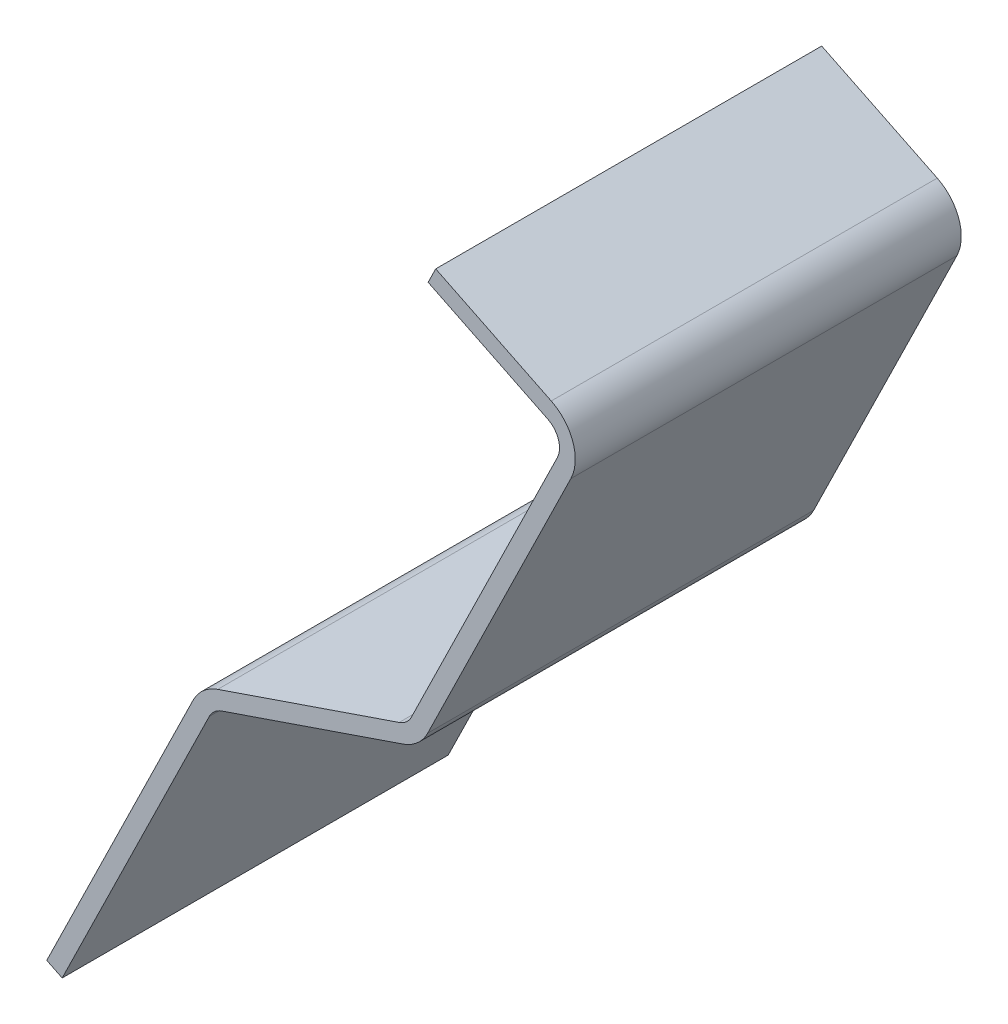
ISO-10303-21;
HEADER;
FILE_DESCRIPTION(('STEP AP214'),'2;1');
FILE_NAME('part.step','',(''),(''),'','','');
FILE_SCHEMA(('AUTOMOTIVE_DESIGN { 1 0 10303 214 1 1 1 1 }'));
ENDSEC;
DATA;
#1=APPLICATION_CONTEXT('core data for automotive mechanical design processes');
#2=APPLICATION_PROTOCOL_DEFINITION('international standard','automotive_design',2000,#1);
#3=PRODUCT_CONTEXT('',#1,'mechanical');
#4=PRODUCT('Part','Part','',(#3));
#5=PRODUCT_RELATED_PRODUCT_CATEGORY('part','',(#4));
#6=PRODUCT_DEFINITION_FORMATION('','',#4);
#7=PRODUCT_DEFINITION_CONTEXT('part definition',#1,'design');
#8=PRODUCT_DEFINITION('design','',#6,#7);
#9=PRODUCT_DEFINITION_SHAPE('','',#8);
#10=(LENGTH_UNIT() NAMED_UNIT(*) SI_UNIT(.MILLI.,.METRE.));
#11=(NAMED_UNIT(*) PLANE_ANGLE_UNIT() SI_UNIT($,.RADIAN.));
#12=(NAMED_UNIT(*) SI_UNIT($,.STERADIAN.) SOLID_ANGLE_UNIT());
#13=UNCERTAINTY_MEASURE_WITH_UNIT(LENGTH_MEASURE(1.E-05),#10,'distance_accuracy_value','');
#14=(GEOMETRIC_REPRESENTATION_CONTEXT(3) GLOBAL_UNCERTAINTY_ASSIGNED_CONTEXT((#13)) GLOBAL_UNIT_ASSIGNED_CONTEXT((#10,
#11,#12)) REPRESENTATION_CONTEXT('',''));
#15=CARTESIAN_POINT('',(0.,0.,0.));
#16=DIRECTION('',(0.,0.,1.));
#17=DIRECTION('',(1.,0.,0.));
#18=AXIS2_PLACEMENT_3D('',#15,#16,#17);
#19=CARTESIAN_POINT('',(88.9357884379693,19.6109610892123,9.));
#20=DIRECTION('',(0.897898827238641,-0.440201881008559,0.));
#21=DIRECTION('',(0.440201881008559,0.897898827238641,0.));
#22=AXIS2_PLACEMENT_3D('',#19,#20,#21);
#23=PLANE('',#22);
#24=DIRECTION('',(-0.440201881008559,-0.897898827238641,0.));
#25=VECTOR('',#24,1.);
#26=CARTESIAN_POINT('',(88.9357884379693,19.6109610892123,9.));
#27=LINE('',#26,#25);
#28=CARTESIAN_POINT('',(88.8263858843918,19.3878079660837,9.));
#29=VERTEX_POINT('',#28);
#30=CARTESIAN_POINT('',(85.4141733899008,12.4277704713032,9.));
#31=VERTEX_POINT('',#30);
#32=EDGE_CURVE('E188',#29,#31,#27,.T.);
#33=ORIENTED_EDGE('',*,*,#32,.F.);
#34=DIRECTION('',(0.,0.,-1.));
#35=VECTOR('',#34,1.);
#36=CARTESIAN_POINT('',(88.8263858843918,19.3878079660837,9.));
#37=LINE('',#36,#35);
#38=CARTESIAN_POINT('',(88.8263858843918,19.3878079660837,0.));
#39=VERTEX_POINT('',#38);
#40=EDGE_CURVE('E36',#29,#39,#37,.T.);
#41=ORIENTED_EDGE('',*,*,#40,.T.);
#42=DIRECTION('',(-0.440201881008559,-0.897898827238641,0.));
#43=VECTOR('',#42,1.);
#44=CARTESIAN_POINT('',(88.9357884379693,19.6109610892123,0.));
#45=LINE('',#44,#43);
#46=CARTESIAN_POINT('',(85.4141733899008,12.4277704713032,0.));
#47=VERTEX_POINT('',#46);
#48=EDGE_CURVE('E143',#39,#47,#45,.T.);
#49=ORIENTED_EDGE('',*,*,#48,.T.);
#50=DIRECTION('',(0.,0.,-1.));
#51=VECTOR('',#50,1.);
#52=CARTESIAN_POINT('',(85.4141733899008,12.4277704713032,9.));
#53=LINE('',#52,#51);
#54=EDGE_CURVE('E146',#31,#47,#53,.T.);
#55=ORIENTED_EDGE('',*,*,#54,.F.);
#56=EDGE_LOOP('',(#33,#41,#49,#55));
#57=FACE_BOUND('',#56,.T.);
#58=ADVANCED_FACE('F29',(#57),#23,.F.);
#59=CARTESIAN_POINT('',(85.7733329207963,12.2516897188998,9.));
#60=DIRECTION('',(-0.440201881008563,-0.897898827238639,0.));
#61=DIRECTION('',(0.897898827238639,-0.440201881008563,0.));
#62=AXIS2_PLACEMENT_3D('',#59,#60,#61);
#63=PLANE('',#62);
#64=DIRECTION('',(-0.897898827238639,0.440201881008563,0.));
#65=VECTOR('',#64,1.);
#66=CARTESIAN_POINT('',(85.7733329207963,12.2516897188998,0.));
#67=LINE('',#66,#65);
#68=CARTESIAN_POINT('',(85.7733329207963,12.2516897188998,0.));
#69=VERTEX_POINT('',#68);
#70=EDGE_CURVE('E151',#69,#47,#67,.T.);
#71=ORIENTED_EDGE('',*,*,#70,.F.);
#72=DIRECTION('',(0.,0.,-1.));
#73=VECTOR('',#72,1.);
#74=CARTESIAN_POINT('',(85.7733329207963,12.2516897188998,9.));
#75=LINE('',#74,#73);
#76=CARTESIAN_POINT('',(85.7733329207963,12.2516897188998,9.));
#77=VERTEX_POINT('',#76);
#78=EDGE_CURVE('E160',#77,#69,#75,.T.);
#79=ORIENTED_EDGE('',*,*,#78,.F.);
#80=DIRECTION('',(-0.897898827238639,0.440201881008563,0.));
#81=VECTOR('',#80,1.);
#82=CARTESIAN_POINT('',(85.7733329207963,12.2516897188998,9.));
#83=LINE('',#82,#81);
#84=EDGE_CURVE('E158',#77,#31,#83,.T.);
#85=ORIENTED_EDGE('',*,*,#84,.T.);
#86=ORIENTED_EDGE('',*,*,#54,.T.);
#87=EDGE_LOOP('',(#71,#79,#85,#86));
#88=FACE_BOUND('',#87,.T.);
#89=ADVANCED_FACE('F155',(#88),#63,.T.);
#90=CARTESIAN_POINT('',(89.2949479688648,19.4348803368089,9.));
#91=DIRECTION('',(0.897898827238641,-0.440201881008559,0.));
#92=DIRECTION('',(0.440201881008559,0.897898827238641,0.));
#93=AXIS2_PLACEMENT_3D('',#90,#91,#92);
#94=PLANE('',#93);
#95=DIRECTION('',(-0.440201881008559,-0.897898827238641,0.));
#96=VECTOR('',#95,1.);
#97=CARTESIAN_POINT('',(89.2949479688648,19.4348803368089,0.));
#98=LINE('',#97,#96);
#99=CARTESIAN_POINT('',(89.2037791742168,19.2489194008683,0.));
#100=VERTEX_POINT('',#99);
#101=EDGE_CURVE('E165',#100,#69,#98,.T.);
#102=ORIENTED_EDGE('',*,*,#101,.F.);
#103=DIRECTION('',(0.,0.,-1.));
#104=VECTOR('',#103,1.);
#105=CARTESIAN_POINT('',(89.2037791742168,19.2489194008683,9.));
#106=LINE('',#105,#104);
#107=CARTESIAN_POINT('',(89.2037791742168,19.2489194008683,9.));
#108=VERTEX_POINT('',#107);
#109=EDGE_CURVE('E230',#100,#108,#106,.F.);
#110=ORIENTED_EDGE('',*,*,#109,.T.);
#111=DIRECTION('',(-0.440201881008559,-0.897898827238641,0.));
#112=VECTOR('',#111,1.);
#113=CARTESIAN_POINT('',(89.2949479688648,19.4348803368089,9.));
#114=LINE('',#113,#112);
#115=EDGE_CURVE('E191',#108,#77,#114,.T.);
#116=ORIENTED_EDGE('',*,*,#115,.T.);
#117=ORIENTED_EDGE('',*,*,#78,.T.);
#118=EDGE_LOOP('',(#102,#110,#116,#117));
#119=FACE_BOUND('',#118,.T.);
#120=ADVANCED_FACE('F293',(#119),#94,.T.);
#121=CARTESIAN_POINT('',(94.1121105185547,21.0825893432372,9.));
#122=DIRECTION('',(0.323640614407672,-0.946180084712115,0.));
#123=DIRECTION('',(0.946180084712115,0.323640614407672,0.));
#124=AXIS2_PLACEMENT_3D('',#121,#122,#123);
#125=PLANE('',#124);
#126=DIRECTION('',(-0.946180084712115,-0.323640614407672,0.));
#127=VECTOR('',#126,1.);
#128=CARTESIAN_POINT('',(94.1121105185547,21.0825893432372,0.));
#129=LINE('',#128,#127);
#130=CARTESIAN_POINT('',(93.7201898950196,20.9485330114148,0.));
#131=VERTEX_POINT('',#130);
#132=CARTESIAN_POINT('',(89.4909082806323,19.5019085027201,0.));
#133=VERTEX_POINT('',#132);
#134=EDGE_CURVE('E168',#131,#133,#129,.T.);
#135=ORIENTED_EDGE('',*,*,#134,.F.);
#136=DIRECTION('',(0.,0.,-1.));
#137=VECTOR('',#136,1.);
#138=CARTESIAN_POINT('',(93.7201898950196,20.9485330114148,9.));
#139=LINE('',#138,#137);
#140=CARTESIAN_POINT('',(93.7201898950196,20.9485330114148,9.));
#141=VERTEX_POINT('',#140);
#142=EDGE_CURVE('E49',#131,#141,#139,.F.);
#143=ORIENTED_EDGE('',*,*,#142,.T.);
#144=DIRECTION('',(-0.946180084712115,-0.323640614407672,0.));
#145=VECTOR('',#144,1.);
#146=CARTESIAN_POINT('',(94.1121105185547,21.0825893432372,9.));
#147=LINE('',#146,#145);
#148=CARTESIAN_POINT('',(89.4909082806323,19.5019085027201,9.));
#149=VERTEX_POINT('',#148);
#150=EDGE_CURVE('E193',#141,#149,#147,.T.);
#151=ORIENTED_EDGE('',*,*,#150,.T.);
#152=DIRECTION('',(0.,0.,-1.));
#153=VECTOR('',#152,1.);
#154=CARTESIAN_POINT('',(89.4909082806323,19.5019085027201,0.));
#155=LINE('',#154,#153);
#156=EDGE_CURVE('E227',#149,#133,#155,.T.);
#157=ORIENTED_EDGE('',*,*,#156,.T.);
#158=EDGE_LOOP('',(#135,#143,#151,#157));
#159=FACE_BOUND('',#158,.T.);
#160=ADVANCED_FACE('F286',(#159),#125,.T.);
#161=CARTESIAN_POINT('',(94.1121105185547,21.0825893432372,9.));
#162=DIRECTION('',(0.89789882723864,-0.44020188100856,0.));
#163=DIRECTION('',(0.440201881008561,0.89789882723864,0.));
#164=AXIS2_PLACEMENT_3D('',#161,#162,#163);
#165=PLANE('',#164);
#166=DIRECTION('',(-0.44020188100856,-0.89789882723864,0.));
#167=VECTOR('',#166,1.);
#168=CARTESIAN_POINT('',(94.1121105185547,21.0825893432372,0.));
#169=LINE('',#168,#167);
#170=CARTESIAN_POINT('',(97.6337255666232,28.2657799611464,0.));
#171=VERTEX_POINT('',#170);
#172=CARTESIAN_POINT('',(94.2944481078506,21.4545112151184,0.));
#173=VERTEX_POINT('',#172);
#174=EDGE_CURVE('E172',#171,#173,#169,.T.);
#175=ORIENTED_EDGE('',*,*,#174,.F.);
#176=DIRECTION('',(0.,0.,-1.));
#177=VECTOR('',#176,1.);
#178=CARTESIAN_POINT('',(97.6337255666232,28.2657799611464,9.));
#179=LINE('',#178,#177);
#180=CARTESIAN_POINT('',(97.6337255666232,28.2657799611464,9.));
#181=VERTEX_POINT('',#180);
#182=EDGE_CURVE('E257',#171,#181,#179,.F.);
#183=ORIENTED_EDGE('',*,*,#182,.T.);
#184=DIRECTION('',(-0.44020188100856,-0.89789882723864,0.));
#185=VECTOR('',#184,1.);
#186=CARTESIAN_POINT('',(94.1121105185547,21.0825893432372,9.));
#187=LINE('',#186,#185);
#188=CARTESIAN_POINT('',(94.2944481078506,21.4545112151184,9.));
#189=VERTEX_POINT('',#188);
#190=EDGE_CURVE('E195',#181,#189,#187,.T.);
#191=ORIENTED_EDGE('',*,*,#190,.T.);
#192=DIRECTION('',(0.,0.,-1.));
#193=VECTOR('',#192,1.);
#194=CARTESIAN_POINT('',(94.2944481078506,21.4545112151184,9.));
#195=LINE('',#194,#193);
#196=EDGE_CURVE('E254',#189,#173,#195,.T.);
#197=ORIENTED_EDGE('',*,*,#196,.T.);
#198=EDGE_LOOP('',(#175,#183,#191,#197));
#199=FACE_BOUND('',#198,.T.);
#200=ADVANCED_FACE('F280',(#199),#165,.T.);
#201=CARTESIAN_POINT('',(95.3802309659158,30.4842844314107,9.));
#202=DIRECTION('',(0.440201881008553,0.897898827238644,0.));
#203=DIRECTION('',(-0.897898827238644,0.440201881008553,0.));
#204=AXIS2_PLACEMENT_3D('',#201,#202,#203);
#205=PLANE('',#204);
#206=DIRECTION('',(0.897898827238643,-0.440201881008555,0.));
#207=VECTOR('',#206,1.);
#208=CARTESIAN_POINT('',(98.0739274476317,29.163678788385,9.));
#209=LINE('',#208,#207);
#210=CARTESIAN_POINT('',(94.4823321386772,30.9244863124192,9.));
#211=VERTEX_POINT('',#210);
#212=CARTESIAN_POINT('',(97.1760286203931,29.6038806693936,9.));
#213=VERTEX_POINT('',#212);
#214=EDGE_CURVE('E198',#211,#213,#209,.T.);
#215=ORIENTED_EDGE('',*,*,#214,.T.);
#216=DIRECTION('',(0.,0.,-1.));
#217=VECTOR('',#216,1.);
#218=CARTESIAN_POINT('',(97.1760286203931,29.6038806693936,9.));
#219=LINE('',#218,#217);
#220=CARTESIAN_POINT('',(97.1760286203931,29.6038806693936,0.));
#221=VERTEX_POINT('',#220);
#222=EDGE_CURVE('E245',#213,#221,#219,.T.);
#223=ORIENTED_EDGE('',*,*,#222,.T.);
#224=DIRECTION('',(0.897898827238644,-0.440201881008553,0.));
#225=VECTOR('',#224,1.);
#226=CARTESIAN_POINT('',(95.3802309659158,30.4842844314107,0.));
#227=LINE('',#226,#225);
#228=CARTESIAN_POINT('',(94.4823321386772,30.9244863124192,0.));
#229=VERTEX_POINT('',#228);
#230=EDGE_CURVE('E175',#229,#221,#227,.T.);
#231=ORIENTED_EDGE('',*,*,#230,.F.);
#232=DIRECTION('',(0.,0.,-1.));
#233=VECTOR('',#232,1.);
#234=CARTESIAN_POINT('',(94.4823321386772,30.9244863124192,9.));
#235=LINE('',#234,#233);
#236=EDGE_CURVE('E215',#211,#229,#235,.T.);
#237=ORIENTED_EDGE('',*,*,#236,.F.);
#238=EDGE_LOOP('',(#215,#223,#231,#237));
#239=FACE_BOUND('',#238,.T.);
#240=ADVANCED_FACE('F275',(#239),#205,.T.);
#241=CARTESIAN_POINT('',(94.3062513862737,30.5653267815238,9.));
#242=DIRECTION('',(-0.897898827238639,0.440201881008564,0.));
#243=DIRECTION('',(-0.440201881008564,-0.897898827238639,0.));
#244=AXIS2_PLACEMENT_3D('',#241,#242,#243);
#245=PLANE('',#244);
#246=DIRECTION('',(0.440201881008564,0.897898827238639,0.));
#247=VECTOR('',#246,1.);
#248=CARTESIAN_POINT('',(94.3062513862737,30.5653267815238,0.));
#249=LINE('',#248,#247);
#250=CARTESIAN_POINT('',(94.3062513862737,30.5653267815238,0.));
#251=VERTEX_POINT('',#250);
#252=EDGE_CURVE('E177',#251,#229,#249,.T.);
#253=ORIENTED_EDGE('',*,*,#252,.F.);
#254=DIRECTION('',(0.,0.,-1.));
#255=VECTOR('',#254,1.);
#256=CARTESIAN_POINT('',(94.3062513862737,30.5653267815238,9.));
#257=LINE('',#256,#255);
#258=CARTESIAN_POINT('',(94.3062513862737,30.5653267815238,9.));
#259=VERTEX_POINT('',#258);
#260=EDGE_CURVE('E212',#259,#251,#257,.T.);
#261=ORIENTED_EDGE('',*,*,#260,.F.);
#262=DIRECTION('',(0.440201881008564,0.897898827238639,0.));
#263=VECTOR('',#262,1.);
#264=CARTESIAN_POINT('',(94.3062513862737,30.5653267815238,9.));
#265=LINE('',#264,#263);
#266=EDGE_CURVE('E201',#259,#211,#265,.T.);
#267=ORIENTED_EDGE('',*,*,#266,.T.);
#268=ORIENTED_EDGE('',*,*,#236,.T.);
#269=EDGE_LOOP('',(#253,#261,#267,#268));
#270=FACE_BOUND('',#269,.T.);
#271=ADVANCED_FACE('F319',(#270),#245,.T.);
#272=CARTESIAN_POINT('',(97.8978466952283,28.8045192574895,9.));
#273=DIRECTION('',(0.440201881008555,0.897898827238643,0.));
#274=DIRECTION('',(-0.897898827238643,0.440201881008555,0.));
#275=AXIS2_PLACEMENT_3D('',#272,#273,#274);
#276=PLANE('',#275);
#277=DIRECTION('',(0.897898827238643,-0.440201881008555,0.));
#278=VECTOR('',#277,1.);
#279=CARTESIAN_POINT('',(97.8978466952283,28.8045192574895,0.));
#280=LINE('',#279,#278);
#281=CARTESIAN_POINT('',(97.0897377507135,29.2007009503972,0.));
#282=VERTEX_POINT('',#281);
#283=EDGE_CURVE('E180',#251,#282,#280,.T.);
#284=ORIENTED_EDGE('',*,*,#283,.T.);
#285=DIRECTION('',(0.,0.,-1.));
#286=VECTOR('',#285,1.);
#287=CARTESIAN_POINT('',(97.0897377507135,29.2007009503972,9.));
#288=LINE('',#287,#286);
#289=CARTESIAN_POINT('',(97.0897377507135,29.2007009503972,9.));
#290=VERTEX_POINT('',#289);
#291=EDGE_CURVE('E225',#282,#290,#288,.F.);
#292=ORIENTED_EDGE('',*,*,#291,.T.);
#293=DIRECTION('',(0.897898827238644,-0.440201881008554,0.));
#294=VECTOR('',#293,1.);
#295=CARTESIAN_POINT('',(95.2041502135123,30.1251249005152,9.));
#296=LINE('',#295,#294);
#297=EDGE_CURVE('E204',#259,#290,#296,.T.);
#298=ORIENTED_EDGE('',*,*,#297,.F.);
#299=ORIENTED_EDGE('',*,*,#260,.T.);
#300=EDGE_LOOP('',(#284,#292,#298,#299));
#301=FACE_BOUND('',#300,.T.);
#302=ADVANCED_FACE('F315',(#301),#276,.F.);
#303=CARTESIAN_POINT('',(93.7529509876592,21.2586700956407,9.));
#304=DIRECTION('',(0.89789882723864,-0.44020188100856,0.));
#305=DIRECTION('',(0.44020188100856,0.89789882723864,0.));
#306=AXIS2_PLACEMENT_3D('',#303,#304,#305);
#307=PLANE('',#306);
#308=DIRECTION('',(-0.440201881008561,-0.89789882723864,0.));
#309=VECTOR('',#308,1.);
#310=CARTESIAN_POINT('',(93.7529509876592,21.2586700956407,0.));
#311=LINE('',#310,#309);
#312=CARTESIAN_POINT('',(97.3185862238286,28.5316505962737,0.));
#313=VERTEX_POINT('',#312);
#314=CARTESIAN_POINT('',(93.9170548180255,21.5933997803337,0.));
#315=VERTEX_POINT('',#314);
#316=EDGE_CURVE('E183',#313,#315,#311,.T.);
#317=ORIENTED_EDGE('',*,*,#316,.T.);
#318=DIRECTION('',(0.,0.,-1.));
#319=VECTOR('',#318,1.);
#320=CARTESIAN_POINT('',(93.9170548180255,21.5933997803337,9.));
#321=LINE('',#320,#319);
#322=CARTESIAN_POINT('',(93.9170548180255,21.5933997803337,9.));
#323=VERTEX_POINT('',#322);
#324=EDGE_CURVE('E223',#315,#323,#321,.F.);
#325=ORIENTED_EDGE('',*,*,#324,.T.);
#326=DIRECTION('',(-0.440201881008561,-0.89789882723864,0.));
#327=VECTOR('',#326,1.);
#328=CARTESIAN_POINT('',(93.7529509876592,21.2586700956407,9.));
#329=LINE('',#328,#327);
#330=CARTESIAN_POINT('',(97.3185862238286,28.5316505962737,9.));
#331=VERTEX_POINT('',#330);
#332=EDGE_CURVE('E207',#331,#323,#329,.T.);
#333=ORIENTED_EDGE('',*,*,#332,.F.);
#334=DIRECTION('',(0.,0.,-1.));
#335=VECTOR('',#334,1.);
#336=CARTESIAN_POINT('',(97.3185862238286,28.5316505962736,0.));
#337=LINE('',#336,#335);
#338=EDGE_CURVE('E220',#331,#313,#337,.T.);
#339=ORIENTED_EDGE('',*,*,#338,.T.);
#340=EDGE_LOOP('',(#317,#325,#333,#339));
#341=FACE_BOUND('',#340,.T.);
#342=ADVANCED_FACE('F307',(#341),#307,.F.);
#343=CARTESIAN_POINT('',(93.9826542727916,21.4610613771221,9.));
#344=DIRECTION('',(0.323640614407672,-0.946180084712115,0.));
#345=DIRECTION('',(0.946180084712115,0.323640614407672,0.));
#346=AXIS2_PLACEMENT_3D('',#343,#344,#345);
#347=PLANE('',#346);
#348=DIRECTION('',(-0.946180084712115,-0.323640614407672,0.));
#349=VECTOR('',#348,1.);
#350=CARTESIAN_POINT('',(93.9826542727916,21.4610613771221,0.));
#351=LINE('',#350,#349);
#352=CARTESIAN_POINT('',(93.6299257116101,21.3404106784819,0.));
#353=VERTEX_POINT('',#352);
#354=CARTESIAN_POINT('',(89.4006440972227,19.8937861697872,0.));
#355=VERTEX_POINT('',#354);
#356=EDGE_CURVE('E186',#353,#355,#351,.T.);
#357=ORIENTED_EDGE('',*,*,#356,.T.);
#358=DIRECTION('',(0.,0.,-1.));
#359=VECTOR('',#358,1.);
#360=CARTESIAN_POINT('',(89.4006440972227,19.8937861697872,9.));
#361=LINE('',#360,#359);
#362=CARTESIAN_POINT('',(89.4006440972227,19.8937861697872,9.));
#363=VERTEX_POINT('',#362);
#364=EDGE_CURVE('E11',#355,#363,#361,.F.);
#365=ORIENTED_EDGE('',*,*,#364,.T.);
#366=DIRECTION('',(-0.946180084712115,-0.323640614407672,0.));
#367=VECTOR('',#366,1.);
#368=CARTESIAN_POINT('',(93.9826542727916,21.4610613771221,9.));
#369=LINE('',#368,#367);
#370=CARTESIAN_POINT('',(93.6299257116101,21.3404106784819,9.));
#371=VERTEX_POINT('',#370);
#372=EDGE_CURVE('E210',#371,#363,#369,.T.);
#373=ORIENTED_EDGE('',*,*,#372,.F.);
#374=DIRECTION('',(0.,0.,-1.));
#375=VECTOR('',#374,1.);
#376=CARTESIAN_POINT('',(93.6299257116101,21.3404106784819,0.));
#377=LINE('',#376,#375);
#378=EDGE_CURVE('E159',#371,#353,#377,.T.);
#379=ORIENTED_EDGE('',*,*,#378,.T.);
#380=EDGE_LOOP('',(#357,#365,#373,#379));
#381=FACE_BOUND('',#380,.T.);
#382=ADVANCED_FACE('F299',(#381),#347,.F.);
#383=CARTESIAN_POINT('',(94.4823321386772,30.9244863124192,9.));
#384=DIRECTION('',(0.,0.,1.));
#385=DIRECTION('',(1.,0.,0.));
#386=AXIS2_PLACEMENT_3D('',#383,#384,#385);
#387=PLANE('',#386);
#388=ORIENTED_EDGE('',*,*,#190,.F.);
#389=CARTESIAN_POINT('',(96.7358267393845,28.7059818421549,9.));
#390=DIRECTION('',(0.,0.,1.));
#391=DIRECTION('',(1.,0.,0.));
#392=AXIS2_PLACEMENT_3D('',#389,#390,#391);
#393=CIRCLE('',#392,1.);
#394=EDGE_CURVE('E263',#181,#213,#393,.T.);
#395=ORIENTED_EDGE('',*,*,#394,.T.);
#396=ORIENTED_EDGE('',*,*,#214,.F.);
#397=ORIENTED_EDGE('',*,*,#266,.F.);
#398=ORIENTED_EDGE('',*,*,#297,.T.);
#399=CARTESIAN_POINT('',(96.8696368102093,28.7517515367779,9.));
#400=DIRECTION('',(0.,0.,1.));
#401=DIRECTION('',(1.,0.,0.));
#402=AXIS2_PLACEMENT_3D('',#399,#400,#401);
#403=CIRCLE('',#402,0.5);
#404=EDGE_CURVE('E238',#290,#331,#403,.F.);
#405=ORIENTED_EDGE('',*,*,#404,.T.);
#406=ORIENTED_EDGE('',*,*,#332,.T.);
#407=CARTESIAN_POINT('',(93.4681054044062,21.813500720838,9.));
#408=DIRECTION('',(0.,0.,1.));
#409=DIRECTION('',(1.,0.,0.));
#410=AXIS2_PLACEMENT_3D('',#407,#408,#409);
#411=CIRCLE('',#410,0.5);
#412=EDGE_CURVE('E234',#323,#371,#411,.F.);
#413=ORIENTED_EDGE('',*,*,#412,.T.);
#414=ORIENTED_EDGE('',*,*,#372,.T.);
#415=CARTESIAN_POINT('',(89.7242847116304,18.9476060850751,9.));
#416=DIRECTION('',(0.,0.,1.));
#417=DIRECTION('',(1.,0.,0.));
#418=AXIS2_PLACEMENT_3D('',#415,#416,#417);
#419=CIRCLE('',#418,1.);
#420=EDGE_CURVE('E259',#363,#29,#419,.T.);
#421=ORIENTED_EDGE('',*,*,#420,.T.);
#422=ORIENTED_EDGE('',*,*,#32,.T.);
#423=ORIENTED_EDGE('',*,*,#84,.F.);
#424=ORIENTED_EDGE('',*,*,#115,.F.);
#425=CARTESIAN_POINT('',(89.6527285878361,19.0288184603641,9.));
#426=DIRECTION('',(0.,0.,1.));
#427=DIRECTION('',(1.,0.,0.));
#428=AXIS2_PLACEMENT_3D('',#425,#426,#427);
#429=CIRCLE('',#428,0.5);
#430=EDGE_CURVE('E242',#108,#149,#429,.F.);
#431=ORIENTED_EDGE('',*,*,#430,.T.);
#432=ORIENTED_EDGE('',*,*,#150,.F.);
#433=CARTESIAN_POINT('',(93.3965492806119,21.8947130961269,9.));
#434=DIRECTION('',(0.,0.,1.));
#435=DIRECTION('',(1.,0.,0.));
#436=AXIS2_PLACEMENT_3D('',#433,#434,#435);
#437=CIRCLE('',#436,1.);
#438=EDGE_CURVE('E261',#141,#189,#437,.T.);
#439=ORIENTED_EDGE('',*,*,#438,.T.);
#440=EDGE_LOOP('',(#388,#395,#396,#397,#398,#405,#406,#413,#414,#421,#422,#423,#424,#431,#432,#439));
#441=FACE_BOUND('',#440,.T.);
#442=ADVANCED_FACE('F268',(#441),#387,.T.);
#443=CARTESIAN_POINT('',(94.4823321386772,30.9244863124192,0.));
#444=DIRECTION('',(0.,0.,1.));
#445=DIRECTION('',(1.,0.,0.));
#446=AXIS2_PLACEMENT_3D('',#443,#444,#445);
#447=PLANE('',#446);
#448=ORIENTED_EDGE('',*,*,#230,.T.);
#449=CARTESIAN_POINT('',(96.7358267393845,28.7059818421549,0.));
#450=DIRECTION('',(0.,0.,1.));
#451=DIRECTION('',(1.,0.,0.));
#452=AXIS2_PLACEMENT_3D('',#449,#450,#451);
#453=CIRCLE('',#452,1.);
#454=EDGE_CURVE('E252',#221,#171,#453,.F.);
#455=ORIENTED_EDGE('',*,*,#454,.T.);
#456=ORIENTED_EDGE('',*,*,#174,.T.);
#457=CARTESIAN_POINT('',(93.3965492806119,21.8947130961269,0.));
#458=DIRECTION('',(0.,0.,1.));
#459=DIRECTION('',(1.,0.,0.));
#460=AXIS2_PLACEMENT_3D('',#457,#458,#459);
#461=CIRCLE('',#460,1.);
#462=EDGE_CURVE('E250',#173,#131,#461,.F.);
#463=ORIENTED_EDGE('',*,*,#462,.T.);
#464=ORIENTED_EDGE('',*,*,#134,.T.);
#465=CARTESIAN_POINT('',(89.6527285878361,19.0288184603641,0.));
#466=DIRECTION('',(0.,0.,1.));
#467=DIRECTION('',(1.,0.,0.));
#468=AXIS2_PLACEMENT_3D('',#465,#466,#467);
#469=CIRCLE('',#468,0.5);
#470=EDGE_CURVE('E240',#133,#100,#469,.T.);
#471=ORIENTED_EDGE('',*,*,#470,.T.);
#472=ORIENTED_EDGE('',*,*,#101,.T.);
#473=ORIENTED_EDGE('',*,*,#70,.T.);
#474=ORIENTED_EDGE('',*,*,#48,.F.);
#475=CARTESIAN_POINT('',(89.7242847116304,18.9476060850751,0.));
#476=DIRECTION('',(0.,0.,1.));
#477=DIRECTION('',(1.,0.,0.));
#478=AXIS2_PLACEMENT_3D('',#475,#476,#477);
#479=CIRCLE('',#478,1.);
#480=EDGE_CURVE('E248',#39,#355,#479,.F.);
#481=ORIENTED_EDGE('',*,*,#480,.T.);
#482=ORIENTED_EDGE('',*,*,#356,.F.);
#483=CARTESIAN_POINT('',(93.4681054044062,21.813500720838,0.));
#484=DIRECTION('',(0.,0.,1.));
#485=DIRECTION('',(1.,0.,0.));
#486=AXIS2_PLACEMENT_3D('',#483,#484,#485);
#487=CIRCLE('',#486,0.5);
#488=EDGE_CURVE('E232',#353,#315,#487,.T.);
#489=ORIENTED_EDGE('',*,*,#488,.T.);
#490=ORIENTED_EDGE('',*,*,#316,.F.);
#491=CARTESIAN_POINT('',(96.8696368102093,28.7517515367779,0.));
#492=DIRECTION('',(0.,0.,1.));
#493=DIRECTION('',(1.,0.,0.));
#494=AXIS2_PLACEMENT_3D('',#491,#492,#493);
#495=CIRCLE('',#494,0.5);
#496=EDGE_CURVE('E236',#313,#282,#495,.T.);
#497=ORIENTED_EDGE('',*,*,#496,.T.);
#498=ORIENTED_EDGE('',*,*,#283,.F.);
#499=ORIENTED_EDGE('',*,*,#252,.T.);
#500=EDGE_LOOP('',(#448,#455,#456,#463,#464,#471,#472,#473,#474,#481,#482,#489,#490,#497,#498,#499));
#501=FACE_BOUND('',#500,.T.);
#502=ADVANCED_FACE('F163',(#501),#447,.F.);
#503=CARTESIAN_POINT('',(93.4681054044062,21.813500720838,9.));
#504=DIRECTION('',(0.,0.,1.));
#505=DIRECTION('',(1.,0.,0.));
#506=AXIS2_PLACEMENT_3D('',#503,#504,#505);
#507=CYLINDRICAL_SURFACE('',#506,0.5);
#508=ORIENTED_EDGE('',*,*,#412,.F.);
#509=ORIENTED_EDGE('',*,*,#324,.F.);
#510=ORIENTED_EDGE('',*,*,#488,.F.);
#511=ORIENTED_EDGE('',*,*,#378,.F.);
#512=EDGE_LOOP('',(#508,#509,#510,#511));
#513=FACE_BOUND('',#512,.T.);
#514=ADVANCED_FACE('F303',(#513),#507,.F.);
#515=CARTESIAN_POINT('',(96.8696368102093,28.7517515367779,9.));
#516=DIRECTION('',(0.,0.,1.));
#517=DIRECTION('',(1.,0.,0.));
#518=AXIS2_PLACEMENT_3D('',#515,#516,#517);
#519=CYLINDRICAL_SURFACE('',#518,0.5);
#520=ORIENTED_EDGE('',*,*,#404,.F.);
#521=ORIENTED_EDGE('',*,*,#291,.F.);
#522=ORIENTED_EDGE('',*,*,#496,.F.);
#523=ORIENTED_EDGE('',*,*,#338,.F.);
#524=EDGE_LOOP('',(#520,#521,#522,#523));
#525=FACE_BOUND('',#524,.T.);
#526=ADVANCED_FACE('F312',(#525),#519,.F.);
#527=CARTESIAN_POINT('',(89.6527285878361,19.0288184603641,9.));
#528=DIRECTION('',(0.,0.,1.));
#529=DIRECTION('',(1.,0.,0.));
#530=AXIS2_PLACEMENT_3D('',#527,#528,#529);
#531=CYLINDRICAL_SURFACE('',#530,0.5);
#532=ORIENTED_EDGE('',*,*,#430,.F.);
#533=ORIENTED_EDGE('',*,*,#109,.F.);
#534=ORIENTED_EDGE('',*,*,#470,.F.);
#535=ORIENTED_EDGE('',*,*,#156,.F.);
#536=EDGE_LOOP('',(#532,#533,#534,#535));
#537=FACE_BOUND('',#536,.T.);
#538=ADVANCED_FACE('F290',(#537),#531,.F.);
#539=CARTESIAN_POINT('',(96.7358267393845,28.7059818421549,9.));
#540=DIRECTION('',(0.,0.,-1.));
#541=DIRECTION('',(-1.,0.,0.));
#542=AXIS2_PLACEMENT_3D('',#539,#540,#541);
#543=CYLINDRICAL_SURFACE('',#542,1.);
#544=ORIENTED_EDGE('',*,*,#394,.F.);
#545=ORIENTED_EDGE('',*,*,#182,.F.);
#546=ORIENTED_EDGE('',*,*,#454,.F.);
#547=ORIENTED_EDGE('',*,*,#222,.F.);
#548=EDGE_LOOP('',(#544,#545,#546,#547));
#549=FACE_BOUND('',#548,.T.);
#550=ADVANCED_FACE('F277',(#549),#543,.T.);
#551=CARTESIAN_POINT('',(93.3965492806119,21.8947130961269,9.));
#552=DIRECTION('',(0.,0.,-1.));
#553=DIRECTION('',(-1.,0.,0.));
#554=AXIS2_PLACEMENT_3D('',#551,#552,#553);
#555=CYLINDRICAL_SURFACE('',#554,1.);
#556=ORIENTED_EDGE('',*,*,#438,.F.);
#557=ORIENTED_EDGE('',*,*,#142,.F.);
#558=ORIENTED_EDGE('',*,*,#462,.F.);
#559=ORIENTED_EDGE('',*,*,#196,.F.);
#560=EDGE_LOOP('',(#556,#557,#558,#559));
#561=FACE_BOUND('',#560,.T.);
#562=ADVANCED_FACE('F284',(#561),#555,.T.);
#563=CARTESIAN_POINT('',(89.7242847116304,18.9476060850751,9.));
#564=DIRECTION('',(0.,0.,-1.));
#565=DIRECTION('',(-1.,0.,0.));
#566=AXIS2_PLACEMENT_3D('',#563,#564,#565);
#567=CYLINDRICAL_SURFACE('',#566,1.);
#568=ORIENTED_EDGE('',*,*,#420,.F.);
#569=ORIENTED_EDGE('',*,*,#364,.F.);
#570=ORIENTED_EDGE('',*,*,#480,.F.);
#571=ORIENTED_EDGE('',*,*,#40,.F.);
#572=EDGE_LOOP('',(#568,#569,#570,#571));
#573=FACE_BOUND('',#572,.T.);
#574=ADVANCED_FACE('F297',(#573),#567,.T.);
#575=CLOSED_SHELL('',(#58,#89,#120,#160,#200,#240,#271,#302,#342,#382,#442,#502,#514,#526,#538,
#550,#562,#574));
#576=MANIFOLD_SOLID_BREP('B2',#575);
#577=ADVANCED_BREP_SHAPE_REPRESENTATION('',(#18,#576),#14);
#578=SHAPE_DEFINITION_REPRESENTATION(#9,#577);
ENDSEC;
END-ISO-10303-21;
